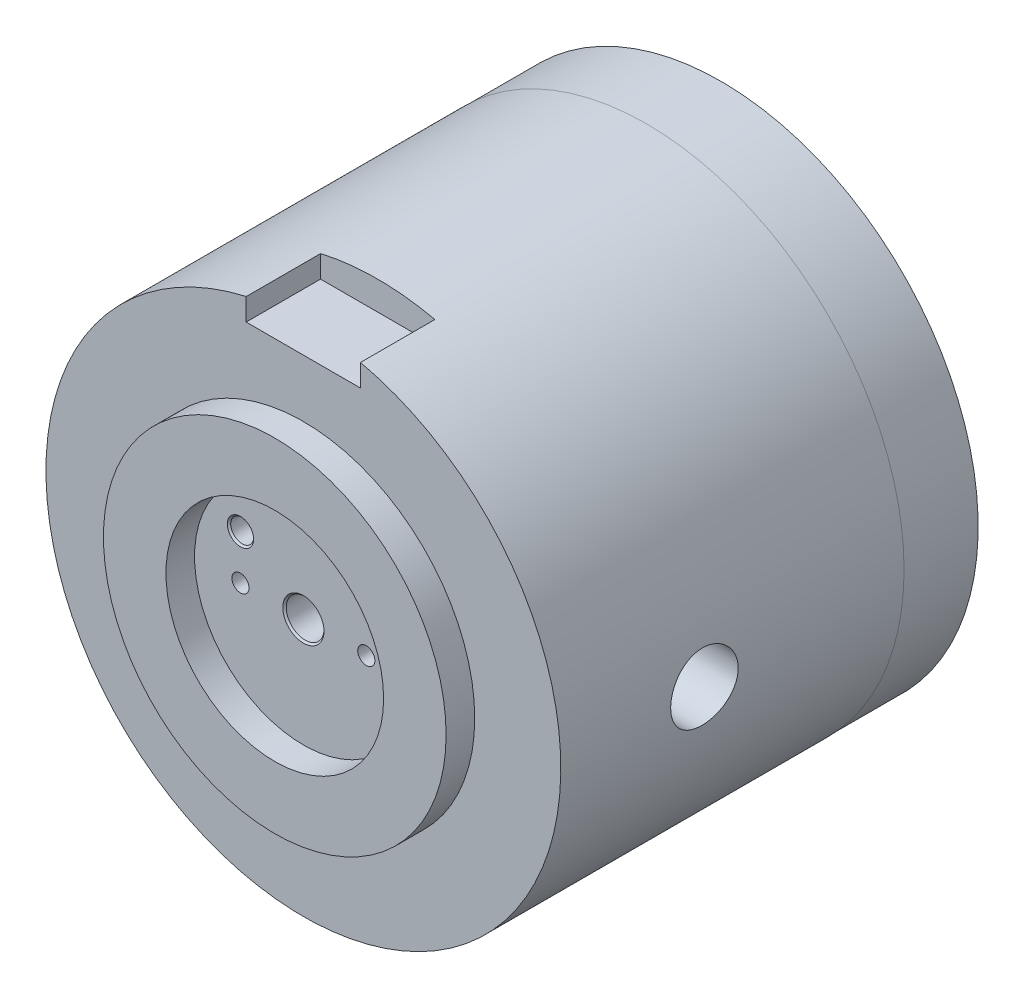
ISO-10303-21;
HEADER;
FILE_DESCRIPTION(('STEP AP214'),'2;1');
FILE_NAME('part.step','',(''),(''),'','','');
FILE_SCHEMA(('AUTOMOTIVE_DESIGN { 1 0 10303 214 1 1 1 1 }'));
ENDSEC;
DATA;
#1=APPLICATION_CONTEXT('core data for automotive mechanical design processes');
#2=APPLICATION_PROTOCOL_DEFINITION('international standard','automotive_design',2000,#1);
#3=PRODUCT_CONTEXT('',#1,'mechanical');
#4=PRODUCT('Part','Part','',(#3));
#5=PRODUCT_RELATED_PRODUCT_CATEGORY('part','',(#4));
#6=PRODUCT_DEFINITION_FORMATION('','',#4);
#7=PRODUCT_DEFINITION_CONTEXT('part definition',#1,'design');
#8=PRODUCT_DEFINITION('design','',#6,#7);
#9=PRODUCT_DEFINITION_SHAPE('','',#8);
#10=(LENGTH_UNIT() NAMED_UNIT(*) SI_UNIT(.MILLI.,.METRE.));
#11=(NAMED_UNIT(*) PLANE_ANGLE_UNIT() SI_UNIT($,.RADIAN.));
#12=(NAMED_UNIT(*) SI_UNIT($,.STERADIAN.) SOLID_ANGLE_UNIT());
#13=UNCERTAINTY_MEASURE_WITH_UNIT(LENGTH_MEASURE(1.E-05),#10,'distance_accuracy_value','');
#14=(GEOMETRIC_REPRESENTATION_CONTEXT(3) GLOBAL_UNCERTAINTY_ASSIGNED_CONTEXT((#13)) GLOBAL_UNIT_ASSIGNED_CONTEXT((#10,
#11,#12)) REPRESENTATION_CONTEXT('',''));
#15=CARTESIAN_POINT('',(0.,0.,0.));
#16=DIRECTION('',(0.,0.,1.));
#17=DIRECTION('',(1.,0.,0.));
#18=AXIS2_PLACEMENT_3D('',#15,#16,#17);
#19=CARTESIAN_POINT('',(0.,0.,60.));
#20=DIRECTION('',(0.,0.,-1.));
#21=DIRECTION('',(-1.,0.,0.));
#22=AXIS2_PLACEMENT_3D('',#19,#20,#21);
#23=CYLINDRICAL_SURFACE('',#22,45.);
#24=CARTESIAN_POINT('',(0.,0.,60.));
#25=DIRECTION('',(0.,0.,1.));
#26=DIRECTION('',(1.,0.,0.));
#27=AXIS2_PLACEMENT_3D('',#24,#25,#26);
#28=CIRCLE('',#27,45.);
#29=CARTESIAN_POINT('',(-9.98468180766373,43.8783104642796,60.));
#30=VERTEX_POINT('',#29);
#31=CARTESIAN_POINT('',(9.98468180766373,43.8783104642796,60.));
#32=VERTEX_POINT('',#31);
#33=EDGE_CURVE('E158',#30,#32,#28,.T.);
#34=ORIENTED_EDGE('',*,*,#33,.F.);
#35=DIRECTION('',(0.,0.,-1.));
#36=VECTOR('',#35,1.);
#37=CARTESIAN_POINT('',(-9.98468180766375,43.8783104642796,60.));
#38=LINE('',#37,#36);
#39=CARTESIAN_POINT('',(-9.98468180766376,43.8783104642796,47.));
#40=VERTEX_POINT('',#39);
#41=EDGE_CURVE('E120',#30,#40,#38,.T.);
#42=ORIENTED_EDGE('',*,*,#41,.T.);
#43=CARTESIAN_POINT('',(0.,0.,47.));
#44=DIRECTION('',(0.,0.,1.));
#45=DIRECTION('',(1.,0.,0.));
#46=AXIS2_PLACEMENT_3D('',#43,#44,#45);
#47=CIRCLE('',#46,45.);
#48=CARTESIAN_POINT('',(9.98468180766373,43.8783104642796,47.));
#49=VERTEX_POINT('',#48);
#50=EDGE_CURVE('E79',#49,#40,#47,.T.);
#51=ORIENTED_EDGE('',*,*,#50,.F.);
#52=DIRECTION('',(0.,0.,-1.));
#53=VECTOR('',#52,1.);
#54=CARTESIAN_POINT('',(9.98468180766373,43.8783104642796,60.));
#55=LINE('',#54,#53);
#56=EDGE_CURVE('E114',#49,#32,#55,.F.);
#57=ORIENTED_EDGE('',*,*,#56,.T.);
#58=EDGE_LOOP('',(#34,#42,#51,#57));
#59=FACE_BOUND('',#58,.T.);
#60=CARTESIAN_POINT('',(-45.,0.,14.0388753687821));
#61=CARTESIAN_POINT('',(-45.0000006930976,-0.164921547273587,14.0418319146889));
#62=CARTESIAN_POINT('',(-44.9990915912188,-0.329938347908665,14.0378654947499));
#63=CARTESIAN_POINT('',(-44.9954739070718,-0.659091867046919,14.0161241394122));
#64=CARTESIAN_POINT('',(-44.9927649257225,-0.823228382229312,13.9983461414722));
#65=CARTESIAN_POINT('',(-44.9856118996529,-1.14951182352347,13.9490906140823));
#66=CARTESIAN_POINT('',(-44.9811665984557,-1.31165722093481,13.9176031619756));
#67=CARTESIAN_POINT('',(-44.9706564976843,-1.63274792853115,13.8411481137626));
#68=CARTESIAN_POINT('',(-44.9645911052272,-1.79169204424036,13.7961755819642));
#69=CARTESIAN_POINT('',(-44.9510113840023,-2.10502824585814,13.6931409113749));
#70=CARTESIAN_POINT('',(-44.9434985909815,-2.2594249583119,13.6350926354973));
#71=CARTESIAN_POINT('',(-44.9272195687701,-2.56281699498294,13.5062784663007));
#72=CARTESIAN_POINT('',(-44.9184528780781,-2.71181030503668,13.4355078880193));
#73=CARTESIAN_POINT('',(-44.8999105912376,-3.00322107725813,13.2818135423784));
#74=CARTESIAN_POINT('',(-44.8901355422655,-3.14564204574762,13.1988963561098));
#75=CARTESIAN_POINT('',(-44.8698338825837,-3.42306321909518,13.0214347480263));
#76=CARTESIAN_POINT('',(-44.8593069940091,-3.55806064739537,12.9268860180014));
#77=CARTESIAN_POINT('',(-44.8377379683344,-3.82029455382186,12.726354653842));
#78=CARTESIAN_POINT('',(-44.8266935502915,-3.94748956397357,12.6203180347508));
#79=CARTESIAN_POINT('',(-44.8044375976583,-4.19255522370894,12.3978969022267));
#80=CARTESIAN_POINT('',(-44.7932260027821,-4.31042240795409,12.2815085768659));
#81=CARTESIAN_POINT('',(-44.7709527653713,-4.53592608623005,12.0392652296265));
#82=CARTESIAN_POINT('',(-44.7598910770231,-4.64356576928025,11.9134131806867));
#83=CARTESIAN_POINT('',(-44.7382166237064,-4.84794190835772,11.6530354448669));
#84=CARTESIAN_POINT('',(-44.7276040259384,-4.94467432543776,11.5185065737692));
#85=CARTESIAN_POINT('',(-44.7070887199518,-5.1268565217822,11.2412188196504));
#86=CARTESIAN_POINT('',(-44.6971888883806,-5.21226163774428,11.0984303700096));
#87=CARTESIAN_POINT('',(-44.6784203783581,-5.3707657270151,10.8060481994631));
#88=CARTESIAN_POINT('',(-44.6695520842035,-5.44386011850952,10.6564519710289));
#89=CARTESIAN_POINT('',(-44.6531071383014,-5.57714480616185,10.3516067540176));
#90=CARTESIAN_POINT('',(-44.6455299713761,-5.63734025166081,10.1963600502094));
#91=CARTESIAN_POINT('',(-44.6318757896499,-5.74443555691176,9.88126552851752));
#92=CARTESIAN_POINT('',(-44.6257993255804,-5.79133053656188,9.721416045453));
#93=CARTESIAN_POINT('',(-44.6101650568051,-5.91100095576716,9.23851617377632));
#94=CARTESIAN_POINT('',(-44.6030917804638,-5.96362808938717,8.91012674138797));
#95=CARTESIAN_POINT('',(-44.5964557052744,-6.01304626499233,8.2492840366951));
#96=CARTESIAN_POINT('',(-44.5968925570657,-6.00983990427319,7.91683095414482));
#97=CARTESIAN_POINT('',(-44.6051845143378,-5.94797956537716,7.25940224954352));
#98=CARTESIAN_POINT('',(-44.6129906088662,-5.8896919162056,6.9343917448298));
#99=CARTESIAN_POINT('',(-44.6350750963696,-5.71990618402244,6.29882662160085));
#100=CARTESIAN_POINT('',(-44.6493536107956,-5.60840710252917,5.98827227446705));
#101=CARTESIAN_POINT('',(-44.6828346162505,-5.33509079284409,5.38950822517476));
#102=CARTESIAN_POINT('',(-44.702049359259,-5.1731481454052,5.10135647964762));
#103=CARTESIAN_POINT('',(-44.743264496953,-4.80361632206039,4.55620095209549));
#104=CARTESIAN_POINT('',(-44.765265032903,-4.59602483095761,4.29919875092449));
#105=CARTESIAN_POINT('',(-44.8098215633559,-4.13918337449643,3.8215562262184));
#106=CARTESIAN_POINT('',(-44.8323805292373,-3.88962516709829,3.60121089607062));
#107=CARTESIAN_POINT('',(-44.8754088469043,-3.35692748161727,3.20548558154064));
#108=CARTESIAN_POINT('',(-44.8958781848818,-3.07378778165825,3.03010589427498));
#109=CARTESIAN_POINT('',(-44.9325039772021,-2.48154821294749,2.72918583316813));
#110=CARTESIAN_POINT('',(-44.9486563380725,-2.17242406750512,2.60369270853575));
#111=CARTESIAN_POINT('',(-44.974858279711,-1.5372280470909,2.40648851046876));
#112=CARTESIAN_POINT('',(-44.9849081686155,-1.2111570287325,2.33477472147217));
#113=CARTESIAN_POINT('',(-44.9977837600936,-0.55382432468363,2.24759747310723));
#114=CARTESIAN_POINT('',(-45.0006607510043,-0.222616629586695,2.23173432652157));
#115=CARTESIAN_POINT('',(-44.9990820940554,0.437762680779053,2.25562007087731));
#116=CARTESIAN_POINT('',(-44.9946266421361,0.766934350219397,2.29536747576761));
#117=CARTESIAN_POINT('',(-44.978980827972,1.41250595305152,2.42900114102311));
#118=CARTESIAN_POINT('',(-44.9678181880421,1.72895276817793,2.52266448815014));
#119=CARTESIAN_POINT('',(-44.9400801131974,2.34165198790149,2.76122110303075));
#120=CARTESIAN_POINT('',(-44.9235044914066,2.63790369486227,2.90611613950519));
#121=CARTESIAN_POINT('',(-44.886727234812,3.2035242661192,3.24390218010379));
#122=CARTESIAN_POINT('',(-44.8665069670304,3.47274336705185,3.43704188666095));
#123=CARTESIAN_POINT('',(-44.8247952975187,3.97509512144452,3.86551720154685));
#124=CARTESIAN_POINT('',(-44.8033038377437,4.20822612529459,4.10085473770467));
#125=CARTESIAN_POINT('',(-44.7613463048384,4.63334887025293,4.60889683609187));
#126=CARTESIAN_POINT('',(-44.7408879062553,4.82505992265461,4.88183700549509));
#127=CARTESIAN_POINT('',(-44.7035093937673,5.15991838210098,5.45627579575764));
#128=CARTESIAN_POINT('',(-44.6865892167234,5.30306665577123,5.75777390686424));
#129=CARTESIAN_POINT('',(-44.6582871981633,5.53635483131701,6.38003175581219));
#130=CARTESIAN_POINT('',(-44.6468925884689,5.62661704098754,6.7007451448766));
#131=CARTESIAN_POINT('',(-44.6309250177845,5.75192784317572,7.3531242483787));
#132=CARTESIAN_POINT('',(-44.6263516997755,5.78697932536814,7.68478938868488));
#133=CARTESIAN_POINT('',(-44.6249953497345,5.79738130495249,8.18155902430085));
#134=CARTESIAN_POINT('',(-44.6254498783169,5.79390084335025,8.34647596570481));
#135=CARTESIAN_POINT('',(-44.6281396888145,5.77315363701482,8.67540918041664));
#136=CARTESIAN_POINT('',(-44.6303743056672,5.75589204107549,8.83942576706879));
#137=CARTESIAN_POINT('',(-44.6365632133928,5.70769667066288,9.16545290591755));
#138=CARTESIAN_POINT('',(-44.6405181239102,5.67675796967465,9.32746271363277));
#139=CARTESIAN_POINT('',(-44.6500296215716,5.60145480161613,9.64822371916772));
#140=CARTESIAN_POINT('',(-44.6555856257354,5.55709522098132,9.80697608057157));
#141=CARTESIAN_POINT('',(-44.6681348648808,5.45530495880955,10.1200599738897));
#142=CARTESIAN_POINT('',(-44.6751271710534,5.3978827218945,10.2743942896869));
#143=CARTESIAN_POINT('',(-44.6903467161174,5.27039159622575,10.5776180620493));
#144=CARTESIAN_POINT('',(-44.6985735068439,5.20032729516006,10.726509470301));
#145=CARTESIAN_POINT('',(-44.7160313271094,5.04801123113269,11.0179300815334));
#146=CARTESIAN_POINT('',(-44.7252627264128,4.96575497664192,11.1604569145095));
#147=CARTESIAN_POINT('',(-44.7444603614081,4.78968712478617,11.4380597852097));
#148=CARTESIAN_POINT('',(-44.7544263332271,4.69587966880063,11.5731384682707));
#149=CARTESIAN_POINT('',(-44.7748900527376,4.49659050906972,11.8359645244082));
#150=CARTESIAN_POINT('',(-44.785391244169,4.39102609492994,11.963648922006));
#151=CARTESIAN_POINT('',(-44.8065498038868,4.16958715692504,12.2096416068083));
#152=CARTESIAN_POINT('',(-44.8172071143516,4.05371637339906,12.3279532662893));
#153=CARTESIAN_POINT('',(-44.8383825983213,3.81236481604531,12.554498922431));
#154=CARTESIAN_POINT('',(-44.8489006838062,3.68687827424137,12.662726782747));
#155=CARTESIAN_POINT('',(-44.8694854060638,3.42727644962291,12.8682286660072));
#156=CARTESIAN_POINT('',(-44.8795522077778,3.29316436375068,12.9655067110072));
#157=CARTESIAN_POINT('',(-44.8989980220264,3.0165043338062,13.1489302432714));
#158=CARTESIAN_POINT('',(-44.908373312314,2.87391727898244,13.2350171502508));
#159=CARTESIAN_POINT('',(-44.9261030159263,2.58198437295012,13.3948289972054));
#160=CARTESIAN_POINT('',(-44.9344578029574,2.4326410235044,13.4685584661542));
#161=CARTESIAN_POINT('',(-44.94989940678,2.12831602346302,13.6031043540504));
#162=CARTESIAN_POINT('',(-44.9569871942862,1.97333879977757,13.6639306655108));
#163=CARTESIAN_POINT('',(-44.9696917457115,1.65879759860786,13.7722768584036));
#164=CARTESIAN_POINT('',(-44.9753088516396,1.49923469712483,13.819799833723));
#165=CARTESIAN_POINT('',(-44.986605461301,1.11939147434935,13.9156359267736));
#166=CARTESIAN_POINT('',(-44.9916017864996,0.897631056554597,13.9582620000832));
#167=CARTESIAN_POINT('',(-44.9982985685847,0.450639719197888,14.0178611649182));
#168=CARTESIAN_POINT('',(-44.9999990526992,0.225408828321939,14.0348344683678));
#169=CARTESIAN_POINT('',(-45.,0.,14.0388753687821));
#170=B_SPLINE_CURVE_WITH_KNOTS('',3,(#60,#61,#62,#63,#64,#65,#66,#67,#68,#69,#70,#71,#72,#73,
#74,#75,#76,#77,#78,#79,#80,#81,#82,#83,#84,#85,#86,#87,#88,#89,#90,#91,#92,#93,#94,#95,#96,#97,
#98,#99,#100,#101,#102,#103,#104,#105,#106,#107,#108,#109,#110,#111,#112,#113,#114,#115,#116,
#117,#118,#119,#120,#121,#122,#123,#124,#125,#126,#127,#128,#129,#130,#131,#132,#133,#134,#135,
#136,#137,#138,#139,#140,#141,#142,#143,#144,#145,#146,#147,#148,#149,#150,#151,#152,#153,#154,
#155,#156,#157,#158,#159,#160,#161,#162,#163,#164,#165,#166,#167,#168,#169),.UNSPECIFIED.,.T.,
.F.,(4,2,2,2,2,2,2,2,2,2,2,2,2,2,2,2,2,2,2,2,2,2,2,2,2,2,2,2,2,2,2,2,2,2,2,2,2,2,2,2,2,2,2,2,2,
2,2,2,2,2,2,2,2,2,4),(0.,0.494646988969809,0.989403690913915,1.48451908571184,1.97981592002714,
2.47459009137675,2.96954683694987,3.4642363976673,3.95910974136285,4.45641874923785,
4.95391165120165,5.45124891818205,5.94876974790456,6.44819739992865,6.94781052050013,
7.44722381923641,7.94682012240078,8.93958302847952,9.9322997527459,10.918460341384,
11.9046394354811,12.8932903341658,13.8819913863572,14.8782997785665,15.8746147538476,
16.8718711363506,17.8690771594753,18.8591321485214,19.8491606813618,20.8351250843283,
21.821123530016,22.8123136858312,23.8035491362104,24.8013046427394,25.7990423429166,
26.7944634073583,27.7898323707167,28.2842134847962,28.7784099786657,29.2727846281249,
29.7669794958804,30.2608557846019,30.7545532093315,31.2484329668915,31.7421361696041,
32.2395628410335,32.7368097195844,33.2343572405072,33.731721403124,34.2315923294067,
34.7312796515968,35.2305824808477,35.7297690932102,36.4058403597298,37.0819060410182),.UNSPECIFIED.);
#171=CARTESIAN_POINT('',(-45.,0.,14.0388753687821));
#172=VERTEX_POINT('',#171);
#173=EDGE_CURVE('E129',#172,#172,#170,.T.);
#174=ORIENTED_EDGE('',*,*,#173,.T.);
#175=EDGE_LOOP('',(#174));
#176=FACE_BOUND('',#175,.T.);
#177=CARTESIAN_POINT('',(44.6671431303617,5.46317898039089,34.8948618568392));
#178=CARTESIAN_POINT('',(44.66714243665,5.46318096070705,34.7298672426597));
#179=CARTESIAN_POINT('',(44.6679925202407,5.45624674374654,34.5649012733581));
#180=CARTESIAN_POINT('',(44.6713655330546,5.42856389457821,34.2360976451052));
#181=CARTESIAN_POINT('',(44.6738888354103,5.40781218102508,34.0722602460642));
#182=CARTESIAN_POINT('',(44.6805346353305,5.35262490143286,33.7468206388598));
#183=CARTESIAN_POINT('',(44.6846583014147,5.31817933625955,33.5852201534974));
#184=CARTESIAN_POINT('',(44.694380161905,5.2358475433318,33.2654617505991));
#185=CARTESIAN_POINT('',(44.6999788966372,5.18795638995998,33.1073051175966));
#186=CARTESIAN_POINT('',(44.7124726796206,5.07915143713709,32.7957817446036));
#187=CARTESIAN_POINT('',(44.7193663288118,5.01825168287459,32.6424100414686));
#188=CARTESIAN_POINT('',(44.7342474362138,4.88381801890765,32.3412952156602));
#189=CARTESIAN_POINT('',(44.7422352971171,4.81027945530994,32.1935541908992));
#190=CARTESIAN_POINT('',(44.7590565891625,4.651155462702,31.9048645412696));
#191=CARTESIAN_POINT('',(44.767889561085,4.56557656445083,31.7639122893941));
#192=CARTESIAN_POINT('',(44.7861416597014,4.38291448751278,31.48963550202));
#193=CARTESIAN_POINT('',(44.7955610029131,4.28582704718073,31.3563138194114));
#194=CARTESIAN_POINT('',(44.8147478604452,4.0803277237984,31.0976093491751));
#195=CARTESIAN_POINT('',(44.8245169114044,3.97186036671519,30.9722707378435));
#196=CARTESIAN_POINT('',(44.8440626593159,3.74473459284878,30.731107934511));
#197=CARTESIAN_POINT('',(44.8538393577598,3.62607242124,30.6152872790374));
#198=CARTESIAN_POINT('',(44.8730938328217,3.37945827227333,30.3940539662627));
#199=CARTESIAN_POINT('',(44.8825717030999,3.25150924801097,30.2886380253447));
#200=CARTESIAN_POINT('',(44.9009422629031,2.98713002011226,30.088874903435));
#201=CARTESIAN_POINT('',(44.9098347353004,2.85069670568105,29.9945318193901));
#202=CARTESIAN_POINT('',(44.9267800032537,2.56988006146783,29.8173370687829));
#203=CARTESIAN_POINT('',(44.934829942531,2.42547207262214,29.7345241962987));
#204=CARTESIAN_POINT('',(44.9498011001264,2.13008522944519,29.5813284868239));
#205=CARTESIAN_POINT('',(44.9567218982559,1.97910395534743,29.5109502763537));
#206=CARTESIAN_POINT('',(44.9691995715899,1.67173811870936,29.3832024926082));
#207=CARTESIAN_POINT('',(44.9747569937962,1.51535575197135,29.3258277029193));
#208=CARTESIAN_POINT('',(44.9843245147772,1.19824963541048,29.2244596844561));
#209=CARTESIAN_POINT('',(44.9883340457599,1.03752431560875,29.1804713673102));
#210=CARTESIAN_POINT('',(44.9977583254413,0.552541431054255,29.0696153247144));
#211=CARTESIAN_POINT('',(45.0006584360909,0.223347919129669,29.0229747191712));
#212=CARTESIAN_POINT('',(44.999085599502,-0.437995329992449,28.9855609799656));
#213=CARTESIAN_POINT('',(44.9946129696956,-0.770144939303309,28.9947854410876));
#214=CARTESIAN_POINT('',(44.9785872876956,-1.42604267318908,29.0685138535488));
#215=CARTESIAN_POINT('',(44.9670778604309,-1.74982985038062,29.1326781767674));
#216=CARTESIAN_POINT('',(44.9380309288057,-2.38192687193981,29.3139531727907));
#217=CARTESIAN_POINT('',(44.9204933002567,-2.69023639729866,29.4310649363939));
#218=CARTESIAN_POINT('',(44.8810216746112,-3.2836994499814,29.71526337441));
#219=CARTESIAN_POINT('',(44.8590748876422,-3.56878213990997,29.8824961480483));
#220=CARTESIAN_POINT('',(44.813012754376,-4.10693919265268,30.2620845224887));
#221=CARTESIAN_POINT('',(44.7888972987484,-4.36001194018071,30.4744423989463));
#222=CARTESIAN_POINT('',(44.7407762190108,-4.82897955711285,30.940152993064));
#223=CARTESIAN_POINT('',(44.7167727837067,-5.04458061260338,31.1938019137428));
#224=CARTESIAN_POINT('',(44.6715854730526,-5.43021810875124,31.7338795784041));
#225=CARTESIAN_POINT('',(44.6504016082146,-5.60025437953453,32.0203084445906));
#226=CARTESIAN_POINT('',(44.6131108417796,-5.88997386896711,32.6180872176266));
#227=CARTESIAN_POINT('',(44.597006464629,-6.00963206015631,32.9294494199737));
#228=CARTESIAN_POINT('',(44.571644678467,-6.19494304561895,33.5681135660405));
#229=CARTESIAN_POINT('',(44.5623869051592,-6.26059871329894,33.8954146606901));
#230=CARTESIAN_POINT('',(44.5517778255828,-6.3356564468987,34.5540663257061));
#231=CARTESIAN_POINT('',(44.5503683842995,-6.34547214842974,34.8853688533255));
#232=CARTESIAN_POINT('',(44.5554535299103,-6.30966519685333,35.5448959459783));
#233=CARTESIAN_POINT('',(44.5619479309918,-6.26404384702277,35.8731205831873));
#234=CARTESIAN_POINT('',(44.5820938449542,-6.1190016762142,36.5159240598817));
#235=CARTESIAN_POINT('',(44.5957185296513,-6.01978247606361,36.8305492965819));
#236=CARTESIAN_POINT('',(44.6286495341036,-5.77055864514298,37.4386770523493));
#237=CARTESIAN_POINT('',(44.6479560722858,-5.62055206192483,37.7321787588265));
#238=CARTESIAN_POINT('',(44.6903382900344,-5.27298547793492,38.2915980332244));
#239=CARTESIAN_POINT('',(44.7134351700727,-5.0751548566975,38.5573458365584));
#240=CARTESIAN_POINT('',(44.760897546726,-4.63791803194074,39.051978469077));
#241=CARTESIAN_POINT('',(44.7852630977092,-4.39851004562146,39.2808617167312));
#242=CARTESIAN_POINT('',(44.8328997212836,-3.88308968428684,39.6967308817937));
#243=CARTESIAN_POINT('',(44.8561629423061,-3.60685646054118,39.8834441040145));
#244=CARTESIAN_POINT('',(44.8990399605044,-3.02666085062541,40.2077816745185));
#245=CARTESIAN_POINT('',(44.9186538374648,-2.72269907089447,40.3454070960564));
#246=CARTESIAN_POINT('',(44.9522213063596,-2.09661640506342,40.5672213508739));
#247=CARTESIAN_POINT('',(44.9661913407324,-1.77455142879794,40.6515658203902));
#248=CARTESIAN_POINT('',(44.9872359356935,-1.12043065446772,40.7649075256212));
#249=CARTESIAN_POINT('',(44.9943108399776,-0.788375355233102,40.7939075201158));
#250=CARTESIAN_POINT('',(44.9993596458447,-0.291707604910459,40.7953026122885));
#251=CARTESIAN_POINT('',(45.0001217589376,-0.126919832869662,40.7888385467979));
#252=CARTESIAN_POINT('',(44.9998473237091,0.201520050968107,40.7621541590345));
#253=CARTESIAN_POINT('',(44.9988114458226,0.365172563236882,40.7419389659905));
#254=CARTESIAN_POINT('',(44.9950000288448,0.690240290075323,40.6878868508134));
#255=CARTESIAN_POINT('',(44.992223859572,0.851654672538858,40.6540449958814));
#256=CARTESIAN_POINT('',(44.9850447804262,1.17099905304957,40.5730084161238));
#257=CARTESIAN_POINT('',(44.9806424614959,1.32893029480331,40.5258185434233));
#258=CARTESIAN_POINT('',(44.970366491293,1.6402427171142,40.4184298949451));
#259=CARTESIAN_POINT('',(44.9644929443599,1.79362421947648,40.3582320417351));
#260=CARTESIAN_POINT('',(44.9514719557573,2.09472454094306,40.2252856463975));
#261=CARTESIAN_POINT('',(44.9443249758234,2.24244538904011,40.1525416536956));
#262=CARTESIAN_POINT('',(44.9289815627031,2.5313132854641,39.9949778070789));
#263=CARTESIAN_POINT('',(44.9207847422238,2.67245788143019,39.9101534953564));
#264=CARTESIAN_POINT('',(44.9036030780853,2.94709305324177,39.7290798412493));
#265=CARTESIAN_POINT('',(44.8946185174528,3.08058634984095,39.6328345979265));
#266=CARTESIAN_POINT('',(44.8760648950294,3.34003672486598,39.4287947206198));
#267=CARTESIAN_POINT('',(44.8664919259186,3.46592915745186,39.3209182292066));
#268=CARTESIAN_POINT('',(44.8471224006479,3.70814949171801,39.095017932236));
#269=CARTESIAN_POINT('',(44.8373259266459,3.82448083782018,38.9769978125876));
#270=CARTESIAN_POINT('',(44.8177998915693,4.04688591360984,38.731522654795));
#271=CARTESIAN_POINT('',(44.8080703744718,4.15295340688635,38.6040619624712));
#272=CARTESIAN_POINT('',(44.7889847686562,4.35396787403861,38.3407027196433));
#273=CARTESIAN_POINT('',(44.7796285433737,4.44891893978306,38.2048073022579));
#274=CARTESIAN_POINT('',(44.7615289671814,4.62748518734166,37.9248321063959));
#275=CARTESIAN_POINT('',(44.7527886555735,4.71104582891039,37.7807173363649));
#276=CARTESIAN_POINT('',(44.7362410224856,4.86567424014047,37.4859517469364));
#277=CARTESIAN_POINT('',(44.7284333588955,4.93674659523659,37.3353033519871));
#278=CARTESIAN_POINT('',(44.7139937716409,5.06586451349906,37.028601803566));
#279=CARTESIAN_POINT('',(44.7073609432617,5.12392010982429,36.8725529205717));
#280=CARTESIAN_POINT('',(44.6954698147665,5.22662830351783,36.5561091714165));
#281=CARTESIAN_POINT('',(44.6902111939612,5.27128402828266,36.3957153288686));
#282=CARTESIAN_POINT('',(44.6796482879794,5.36019856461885,36.0145411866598));
#283=CARTESIAN_POINT('',(44.6749805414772,5.39877551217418,35.7923933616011));
#284=CARTESIAN_POINT('',(44.6687284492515,5.45026425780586,35.3450998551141));
#285=CARTESIAN_POINT('',(44.6671440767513,5.46317627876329,35.1199541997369));
#286=CARTESIAN_POINT('',(44.6671431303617,5.46317898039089,34.8948618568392));
#287=B_SPLINE_CURVE_WITH_KNOTS('',3,(#177,#178,#179,#180,#181,#182,#183,#184,#185,#186,#187,
#188,#189,#190,#191,#192,#193,#194,#195,#196,#197,#198,#199,#200,#201,#202,#203,#204,#205,#206,
#207,#208,#209,#210,#211,#212,#213,#214,#215,#216,#217,#218,#219,#220,#221,#222,#223,#224,#225,
#226,#227,#228,#229,#230,#231,#232,#233,#234,#235,#236,#237,#238,#239,#240,#241,#242,#243,#244,
#245,#246,#247,#248,#249,#250,#251,#252,#253,#254,#255,#256,#257,#258,#259,#260,#261,#262,#263,
#264,#265,#266,#267,#268,#269,#270,#271,#272,#273,#274,#275,#276,#277,#278,#279,#280,#281,#282,
#283,#284,#285,#286),.UNSPECIFIED.,.T.,.F.,(4,2,2,2,2,2,2,2,2,2,2,2,2,2,2,2,2,2,2,2,2,2,2,2,2,2,
2,2,2,2,2,2,2,2,2,2,2,2,2,2,2,2,2,2,2,2,2,2,2,2,2,2,2,2,4),(0.,0.49478678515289,
0.989683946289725,1.48494314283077,1.9803840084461,2.47529263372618,2.97038388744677,
3.46520762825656,3.96021517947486,4.45775898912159,4.95548683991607,5.45305710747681,
5.95081089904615,6.45020090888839,6.94977633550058,7.44915099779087,7.94870866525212,
8.94099403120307,9.93323667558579,10.9193893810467,11.905562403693,12.894638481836,
13.8837644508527,14.8803268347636,15.8768929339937,16.8739535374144,17.8709610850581,
18.8605735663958,19.8501627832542,20.8360550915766,21.8219853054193,22.8136308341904,
23.8053188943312,24.803247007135,25.8011532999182,26.7961310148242,27.7910591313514,
28.2853267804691,28.7794101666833,29.2736725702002,29.7677555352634,30.2618034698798,
30.7556726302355,31.2497245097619,31.743599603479,32.2412105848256,32.7386415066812,
33.2363727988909,33.7339203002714,34.2337722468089,34.7334402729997,35.2327218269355,
35.7318867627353,36.4069008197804,37.0819090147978),.UNSPECIFIED.);
#288=CARTESIAN_POINT('',(44.6671431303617,5.46317898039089,34.8948618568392));
#289=VERTEX_POINT('',#288);
#290=EDGE_CURVE('E157',#289,#289,#287,.T.);
#291=ORIENTED_EDGE('',*,*,#290,.T.);
#292=EDGE_LOOP('',(#291));
#293=FACE_BOUND('',#292,.T.);
#294=CARTESIAN_POINT('',(0.,0.,0.));
#295=DIRECTION('',(0.,0.,1.));
#296=DIRECTION('',(1.,0.,0.));
#297=AXIS2_PLACEMENT_3D('',#294,#295,#296);
#298=CIRCLE('',#297,45.);
#299=CARTESIAN_POINT('',(45.,0.,0.));
#300=VERTEX_POINT('',#299);
#301=EDGE_CURVE('E153',#300,#300,#298,.T.);
#302=ORIENTED_EDGE('',*,*,#301,.T.);
#303=EDGE_LOOP('',(#302));
#304=FACE_BOUND('',#303,.T.);
#305=ADVANCED_FACE('F16',(#59,#176,#293,#304),#23,.T.);
#306=CARTESIAN_POINT('',(0.,0.,60.));
#307=DIRECTION('',(0.,0.,1.));
#308=DIRECTION('',(1.,0.,0.));
#309=AXIS2_PLACEMENT_3D('',#306,#307,#308);
#310=PLANE('',#309);
#311=DIRECTION('',(-0.871568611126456,-0.490273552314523,0.));
#312=VECTOR('',#311,1.);
#313=CARTESIAN_POINT('',(-21.149510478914,37.5978867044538,60.));
#314=LINE('',#313,#312);
#315=CARTESIAN_POINT('',(-10.,43.8696936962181,60.));
#316=VERTEX_POINT('',#315);
#317=EDGE_CURVE('E86',#30,#316,#314,.T.);
#318=ORIENTED_EDGE('',*,*,#317,.F.);
#319=ORIENTED_EDGE('',*,*,#33,.T.);
#320=DIRECTION('',(-0.871568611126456,0.490273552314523,0.));
#321=VECTOR('',#320,1.);
#322=CARTESIAN_POINT('',(0.,49.4948796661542,60.));
#323=LINE('',#322,#321);
#324=CARTESIAN_POINT('',(10.,43.8696936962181,60.));
#325=VERTEX_POINT('',#324);
#326=EDGE_CURVE('E82',#325,#32,#323,.T.);
#327=ORIENTED_EDGE('',*,*,#326,.F.);
#328=DIRECTION('',(0.,1.,0.));
#329=VECTOR('',#328,1.);
#330=CARTESIAN_POINT('',(10.,40.,60.));
#331=LINE('',#330,#329);
#332=CARTESIAN_POINT('',(10.,40.,60.));
#333=VERTEX_POINT('',#332);
#334=EDGE_CURVE('E108',#333,#325,#331,.T.);
#335=ORIENTED_EDGE('',*,*,#334,.F.);
#336=DIRECTION('',(1.,0.,0.));
#337=VECTOR('',#336,1.);
#338=CARTESIAN_POINT('',(-10.,40.,60.));
#339=LINE('',#338,#337);
#340=CARTESIAN_POINT('',(-10.,40.,60.));
#341=VERTEX_POINT('',#340);
#342=EDGE_CURVE('E104',#341,#333,#339,.T.);
#343=ORIENTED_EDGE('',*,*,#342,.F.);
#344=DIRECTION('',(0.,-1.,0.));
#345=VECTOR('',#344,1.);
#346=CARTESIAN_POINT('',(-10.,43.8696936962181,60.));
#347=LINE('',#346,#345);
#348=EDGE_CURVE('E102',#316,#341,#347,.T.);
#349=ORIENTED_EDGE('',*,*,#348,.F.);
#350=EDGE_LOOP('',(#318,#319,#327,#335,#343,#349));
#351=FACE_BOUND('',#350,.T.);
#352=CARTESIAN_POINT('',(0.,0.,60.));
#353=DIRECTION('',(0.,0.,1.));
#354=DIRECTION('',(1.,0.,0.));
#355=AXIS2_PLACEMENT_3D('',#352,#353,#354);
#356=CIRCLE('',#355,29.95);
#357=CARTESIAN_POINT('',(29.95,0.,60.));
#358=VERTEX_POINT('',#357);
#359=EDGE_CURVE('E154',#358,#358,#356,.T.);
#360=ORIENTED_EDGE('',*,*,#359,.F.);
#361=EDGE_LOOP('',(#360));
#362=FACE_BOUND('',#361,.T.);
#363=ADVANCED_FACE('F263',(#351,#362),#310,.T.);
#364=CARTESIAN_POINT('',(0.,0.,0.));
#365=DIRECTION('',(0.,0.,1.));
#366=DIRECTION('',(1.,0.,0.));
#367=AXIS2_PLACEMENT_3D('',#364,#365,#366);
#368=PLANE('',#367);
#369=CARTESIAN_POINT('',(0.,0.,0.));
#370=DIRECTION('',(0.,0.,-1.));
#371=DIRECTION('',(-1.,0.,0.));
#372=AXIS2_PLACEMENT_3D('',#369,#370,#371);
#373=CIRCLE('',#372,44.95);
#374=CARTESIAN_POINT('',(-44.95,0.,0.));
#375=VERTEX_POINT('',#374);
#376=EDGE_CURVE('E126',#375,#375,#373,.T.);
#377=ORIENTED_EDGE('',*,*,#376,.F.);
#378=EDGE_LOOP('',(#377));
#379=FACE_BOUND('',#378,.T.);
#380=ORIENTED_EDGE('',*,*,#301,.F.);
#381=EDGE_LOOP('',(#380));
#382=FACE_BOUND('',#381,.T.);
#383=ADVANCED_FACE('F269',(#379,#382),#368,.F.);
#384=CARTESIAN_POINT('',(0.,0.,65.));
#385=DIRECTION('',(0.,0.,-1.));
#386=DIRECTION('',(-1.,0.,0.));
#387=AXIS2_PLACEMENT_3D('',#384,#385,#386);
#388=CYLINDRICAL_SURFACE('',#387,29.95);
#389=CARTESIAN_POINT('',(0.,0.,65.));
#390=DIRECTION('',(0.,0.,1.));
#391=DIRECTION('',(1.,0.,0.));
#392=AXIS2_PLACEMENT_3D('',#389,#390,#391);
#393=CIRCLE('',#392,29.95);
#394=CARTESIAN_POINT('',(29.95,0.,65.));
#395=VERTEX_POINT('',#394);
#396=EDGE_CURVE('E148',#395,#395,#393,.T.);
#397=ORIENTED_EDGE('',*,*,#396,.F.);
#398=EDGE_LOOP('',(#397));
#399=FACE_BOUND('',#398,.T.);
#400=ORIENTED_EDGE('',*,*,#359,.T.);
#401=EDGE_LOOP('',(#400));
#402=FACE_BOUND('',#401,.T.);
#403=ADVANCED_FACE('F282',(#399,#402),#388,.T.);
#404=CARTESIAN_POINT('',(0.,0.,65.));
#405=DIRECTION('',(0.,0.,1.));
#406=DIRECTION('',(1.,0.,0.));
#407=AXIS2_PLACEMENT_3D('',#404,#405,#406);
#408=PLANE('',#407);
#409=CARTESIAN_POINT('',(0.,0.,65.));
#410=DIRECTION('',(0.,0.,1.));
#411=DIRECTION('',(1.,0.,0.));
#412=AXIS2_PLACEMENT_3D('',#409,#410,#411);
#413=CIRCLE('',#412,19.025);
#414=CARTESIAN_POINT('',(19.025,0.,65.));
#415=VERTEX_POINT('',#414);
#416=EDGE_CURVE('E144',#415,#415,#413,.T.);
#417=ORIENTED_EDGE('',*,*,#416,.F.);
#418=EDGE_LOOP('',(#417));
#419=FACE_BOUND('',#418,.T.);
#420=ORIENTED_EDGE('',*,*,#396,.T.);
#421=EDGE_LOOP('',(#420));
#422=FACE_BOUND('',#421,.T.);
#423=ADVANCED_FACE('F288',(#419,#422),#408,.T.);
#424=CARTESIAN_POINT('',(0.,0.,60.));
#425=DIRECTION('',(0.,0.,1.));
#426=DIRECTION('',(1.,0.,0.));
#427=AXIS2_PLACEMENT_3D('',#424,#425,#426);
#428=CYLINDRICAL_SURFACE('',#427,19.025);
#429=CARTESIAN_POINT('',(0.,0.,60.));
#430=DIRECTION('',(0.,0.,1.));
#431=DIRECTION('',(1.,0.,0.));
#432=AXIS2_PLACEMENT_3D('',#429,#430,#431);
#433=CIRCLE('',#432,19.025);
#434=CARTESIAN_POINT('',(19.025,0.,60.));
#435=VERTEX_POINT('',#434);
#436=EDGE_CURVE('E145',#435,#435,#433,.T.);
#437=ORIENTED_EDGE('',*,*,#436,.F.);
#438=EDGE_LOOP('',(#437));
#439=FACE_BOUND('',#438,.T.);
#440=ORIENTED_EDGE('',*,*,#416,.T.);
#441=EDGE_LOOP('',(#440));
#442=FACE_BOUND('',#441,.T.);
#443=ADVANCED_FACE('F294',(#439,#442),#428,.F.);
#444=CARTESIAN_POINT('',(0.,0.,60.));
#445=DIRECTION('',(0.,0.,1.));
#446=DIRECTION('',(1.,0.,0.));
#447=AXIS2_PLACEMENT_3D('',#444,#445,#446);
#448=PLANE('',#447);
#449=CARTESIAN_POINT('',(-11.,7.78,60.));
#450=DIRECTION('',(0.,0.,1.));
#451=DIRECTION('',(1.,0.,0.));
#452=AXIS2_PLACEMENT_3D('',#449,#450,#451);
#453=CIRCLE('',#452,2.3);
#454=CARTESIAN_POINT('',(-8.7,7.78,60.));
#455=VERTEX_POINT('',#454);
#456=EDGE_CURVE('E25',#455,#455,#453,.F.);
#457=ORIENTED_EDGE('',*,*,#456,.T.);
#458=EDGE_LOOP('',(#457));
#459=FACE_BOUND('',#458,.T.);
#460=CARTESIAN_POINT('',(0.,0.,60.));
#461=DIRECTION('',(0.,0.,1.));
#462=DIRECTION('',(1.,0.,0.));
#463=AXIS2_PLACEMENT_3D('',#460,#461,#462);
#464=CIRCLE('',#463,3.6);
#465=CARTESIAN_POINT('',(3.6,0.,60.));
#466=VERTEX_POINT('',#465);
#467=EDGE_CURVE('E321',#466,#466,#464,.F.);
#468=ORIENTED_EDGE('',*,*,#467,.T.);
#469=EDGE_LOOP('',(#468));
#470=FACE_BOUND('',#469,.T.);
#471=CARTESIAN_POINT('',(-11.,0.,60.));
#472=DIRECTION('',(0.,0.,1.));
#473=DIRECTION('',(1.,0.,0.));
#474=AXIS2_PLACEMENT_3D('',#471,#472,#473);
#475=CIRCLE('',#474,1.5);
#476=CARTESIAN_POINT('',(-9.5,0.,60.));
#477=VERTEX_POINT('',#476);
#478=EDGE_CURVE('E325',#477,#477,#475,.T.);
#479=ORIENTED_EDGE('',*,*,#478,.F.);
#480=EDGE_LOOP('',(#479));
#481=FACE_BOUND('',#480,.T.);
#482=CARTESIAN_POINT('',(11.,0.,60.));
#483=DIRECTION('',(0.,0.,1.));
#484=DIRECTION('',(1.,0.,0.));
#485=AXIS2_PLACEMENT_3D('',#482,#483,#484);
#486=CIRCLE('',#485,1.5);
#487=CARTESIAN_POINT('',(12.5,0.,60.));
#488=VERTEX_POINT('',#487);
#489=EDGE_CURVE('E328',#488,#488,#486,.T.);
#490=ORIENTED_EDGE('',*,*,#489,.F.);
#491=EDGE_LOOP('',(#490));
#492=FACE_BOUND('',#491,.T.);
#493=ORIENTED_EDGE('',*,*,#436,.T.);
#494=EDGE_LOOP('',(#493));
#495=FACE_BOUND('',#494,.T.);
#496=ADVANCED_FACE('F183',(#459,#470,#481,#492,#495),#448,.T.);
#497=CARTESIAN_POINT('',(44.9978455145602,-0.440339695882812,34.8948618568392));
#498=DIRECTION('',(0.999952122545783,-0.00978532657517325,0.));
#499=DIRECTION('',(0.00978532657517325,0.999952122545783,0.));
#500=AXIS2_PLACEMENT_3D('',#497,#498,#499);
#501=CYLINDRICAL_SURFACE('',#500,5.9);
#502=CARTESIAN_POINT('',(14.6792971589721,-0.14364859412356,34.8948618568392));
#503=DIRECTION('',(0.999952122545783,-0.00978532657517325,0.));
#504=DIRECTION('',(0.00978532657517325,0.999952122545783,0.));
#505=AXIS2_PLACEMENT_3D('',#502,#503,#504);
#506=CIRCLE('',#505,5.9);
#507=CARTESIAN_POINT('',(14.7370305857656,5.75606892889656,34.8948618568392));
#508=VERTEX_POINT('',#507);
#509=EDGE_CURVE('E141',#508,#508,#506,.T.);
#510=ORIENTED_EDGE('',*,*,#509,.F.);
#511=EDGE_LOOP('',(#510));
#512=FACE_BOUND('',#511,.T.);
#513=ORIENTED_EDGE('',*,*,#290,.F.);
#514=EDGE_LOOP('',(#513));
#515=FACE_BOUND('',#514,.T.);
#516=ADVANCED_FACE('F177',(#512,#515),#501,.F.);
#517=CARTESIAN_POINT('',(14.6792971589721,-0.14364859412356,34.8948618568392));
#518=DIRECTION('',(0.999952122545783,-0.00978532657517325,0.));
#519=DIRECTION('',(0.00978532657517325,0.999952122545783,0.));
#520=AXIS2_PLACEMENT_3D('',#517,#518,#519);
#521=CONICAL_SURFACE('',#520,5.9,1.02974425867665);
#522=CARTESIAN_POINT('',(12.3628627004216,-0.626582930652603,32.905238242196));
#523=CARTESIAN_POINT('',(12.3343661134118,-0.688587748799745,32.9689473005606));
#524=CARTESIAN_POINT('',(12.3039952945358,-0.74365820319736,33.0385529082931));
#525=CARTESIAN_POINT('',(12.2420454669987,-0.843060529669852,33.1847638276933));
#526=CARTESIAN_POINT('',(12.2104611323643,-0.887336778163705,33.261402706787));
#527=CARTESIAN_POINT('',(12.1502451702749,-0.963901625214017,33.4130424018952));
#528=CARTESIAN_POINT('',(12.1215773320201,-0.996860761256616,33.4876946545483));
#529=CARTESIAN_POINT('',(12.0656984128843,-1.05638662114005,33.6400884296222));
#530=CARTESIAN_POINT('',(12.0384886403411,-1.08294767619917,33.7178326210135));
#531=CARTESIAN_POINT('',(11.9867227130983,-1.13031213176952,33.8758583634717));
#532=CARTESIAN_POINT('',(11.9621650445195,-1.15111882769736,33.9561384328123));
#533=CARTESIAN_POINT('',(11.9170893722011,-1.18734281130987,34.1189896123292));
#534=CARTESIAN_POINT('',(11.8965690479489,-1.20276319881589,34.2015593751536));
#535=CARTESIAN_POINT('',(11.8651837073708,-1.22545651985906,34.3499557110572));
#536=CARTESIAN_POINT('',(11.8531853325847,-1.23378128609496,34.4153809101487));
#537=CARTESIAN_POINT('',(11.8334089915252,-1.2472264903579,34.5471959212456));
#538=CARTESIAN_POINT('',(11.8256301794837,-1.25234757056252,34.6135855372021));
#539=CARTESIAN_POINT('',(11.8149518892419,-1.25932328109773,34.746676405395));
#540=CARTESIAN_POINT('',(11.8120335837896,-1.261190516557,34.8133754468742));
#541=CARTESIAN_POINT('',(11.8112883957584,-1.26167011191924,34.9468146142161));
#542=CARTESIAN_POINT('',(11.8134614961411,-1.26028248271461,35.0135547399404));
#543=CARTESIAN_POINT('',(11.8226798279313,-1.254283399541,35.146311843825));
#544=CARTESIAN_POINT('',(11.8297083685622,-1.24968298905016,35.2123305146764));
#545=CARTESIAN_POINT('',(11.8480388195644,-1.23731608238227,35.3434953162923));
#546=CARTESIAN_POINT('',(11.8593431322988,-1.22954780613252,35.408640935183));
#547=CARTESIAN_POINT('',(11.8855266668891,-1.21082703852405,35.5381156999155));
#548=CARTESIAN_POINT('',(11.9004253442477,-1.19985714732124,35.6024383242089));
#549=CARTESIAN_POINT('',(11.93296938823,-1.1747299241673,35.7297234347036));
#550=CARTESIAN_POINT('',(11.950614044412,-1.16057341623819,35.7926862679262));
#551=CARTESIAN_POINT('',(11.9906319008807,-1.12669060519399,35.92611699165));
#552=CARTESIAN_POINT('',(12.0133201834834,-1.10645602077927,35.9963615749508));
#553=CARTESIAN_POINT('',(12.0604806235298,-1.06134245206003,36.1347725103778));
#554=CARTESIAN_POINT('',(12.0849536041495,-1.03646131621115,36.2029378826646));
#555=CARTESIAN_POINT('',(12.1347698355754,-0.981663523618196,36.3364454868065));
#556=CARTESIAN_POINT('',(12.1601080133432,-0.951773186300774,36.4018003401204));
#557=CARTESIAN_POINT('',(12.2110111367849,-0.886104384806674,36.529342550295));
#558=CARTESIAN_POINT('',(12.2365757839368,-0.850332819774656,36.5915335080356));
#559=CARTESIAN_POINT('',(12.2799511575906,-0.782844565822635,36.6946314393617));
#560=CARTESIAN_POINT('',(12.29791240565,-0.75283654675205,36.7365884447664));
#561=CARTESIAN_POINT('',(12.3331158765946,-0.688582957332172,36.8175800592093));
#562=CARTESIAN_POINT('',(12.350357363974,-0.654333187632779,36.85661170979));
#563=CARTESIAN_POINT('',(12.3836568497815,-0.58064311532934,36.9308678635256));
#564=CARTESIAN_POINT('',(12.3997026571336,-0.541158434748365,36.9660545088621));
#565=CARTESIAN_POINT('',(12.4295000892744,-0.456645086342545,37.030247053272));
#566=CARTESIAN_POINT('',(12.4432570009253,-0.411629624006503,37.0592672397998));
#567=CARTESIAN_POINT('',(12.4632276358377,-0.331748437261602,37.10024540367));
#568=CARTESIAN_POINT('',(12.4704343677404,-0.298411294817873,37.1146761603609));
#569=CARTESIAN_POINT('',(12.4827354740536,-0.229592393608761,37.1384473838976));
#570=CARTESIAN_POINT('',(12.48783228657,-0.194113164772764,37.1477937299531));
#571=CARTESIAN_POINT('',(12.4955170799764,-0.121523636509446,37.1605495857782));
#572=CARTESIAN_POINT('',(12.4980856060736,-0.0844029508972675,37.1639132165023));
#573=CARTESIAN_POINT('',(12.5004270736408,-0.0100518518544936,37.1641391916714));
#574=CARTESIAN_POINT('',(12.5002002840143,0.0271785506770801,37.161002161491));
#575=CARTESIAN_POINT('',(12.4972316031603,0.096971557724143,37.1491611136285));
#576=CARTESIAN_POINT('',(12.4947297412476,0.129642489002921,37.1410119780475));
#577=CARTESIAN_POINT('',(12.4878335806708,0.193337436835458,37.1203249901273));
#578=CARTESIAN_POINT('',(12.4834383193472,0.224360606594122,37.1077849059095));
#579=CARTESIAN_POINT('',(12.4703962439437,0.300156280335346,37.0715555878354));
#580=CARTESIAN_POINT('',(12.4607286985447,0.343602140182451,37.0454687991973));
#581=CARTESIAN_POINT('',(12.438974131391,0.425633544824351,36.9873505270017));
#582=CARTESIAN_POINT('',(12.4268804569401,0.464205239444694,36.9553027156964));
#583=CARTESIAN_POINT('',(12.3921814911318,0.56225979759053,36.8632396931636));
#584=CARTESIAN_POINT('',(12.3681340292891,0.617531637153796,36.7993245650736));
#585=CARTESIAN_POINT('',(12.3183080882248,0.717769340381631,36.6645170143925));
#586=CARTESIAN_POINT('',(12.292524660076,0.762703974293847,36.5936043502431));
#587=CARTESIAN_POINT('',(12.2429893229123,0.840788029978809,36.4532458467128));
#588=CARTESIAN_POINT('',(12.2192455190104,0.874604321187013,36.3841626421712));
#589=CARTESIAN_POINT('',(12.1726122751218,0.936201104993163,36.2430390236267));
#590=CARTESIAN_POINT('',(12.1497235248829,0.963976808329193,36.1709963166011));
#591=CARTESIAN_POINT('',(12.1056953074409,1.01417533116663,36.0244526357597));
#592=CARTESIAN_POINT('',(12.0845580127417,1.03659156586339,35.9499487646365));
#593=CARTESIAN_POINT('',(12.0450280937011,1.07643068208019,35.7989209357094));
#594=CARTESIAN_POINT('',(12.0266349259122,1.09385455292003,35.7223973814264));
#595=CARTESIAN_POINT('',(11.9927284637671,1.12474255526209,35.5633344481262));
#596=CARTESIAN_POINT('',(11.9774294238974,1.1379359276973,35.4806957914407));
#597=CARTESIAN_POINT('',(11.9523121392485,1.15903980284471,35.313927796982));
#598=CARTESIAN_POINT('',(11.9424922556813,1.16695188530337,35.229798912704));
#599=CARTESIAN_POINT('',(11.9293655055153,1.17743470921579,35.0610030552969));
#600=CARTESIAN_POINT('',(11.9260345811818,1.18002518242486,34.9763392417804));
#601=CARTESIAN_POINT('',(11.9262048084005,1.17989202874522,34.8070282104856));
#602=CARTESIAN_POINT('',(11.9297053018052,1.17716891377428,34.7223809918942));
#603=CARTESIAN_POINT('',(11.9423182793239,1.1670857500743,34.5640455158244));
#604=CARTESIAN_POINT('',(11.9507086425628,1.1603199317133,34.4902586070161));
#605=CARTESIAN_POINT('',(11.9717860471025,1.14272461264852,34.3437707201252));
#606=CARTESIAN_POINT('',(11.9844749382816,1.13189336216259,34.2710702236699));
#607=CARTESIAN_POINT('',(12.0133757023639,1.10609520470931,34.126796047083));
#608=CARTESIAN_POINT('',(12.0296021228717,1.09111114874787,34.0552283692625));
#609=CARTESIAN_POINT('',(12.0646835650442,1.05690362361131,33.9138008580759));
#610=CARTESIAN_POINT('',(12.0835385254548,1.03768025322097,33.8439409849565));
#611=CARTESIAN_POINT('',(12.138137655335,0.978422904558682,33.6536837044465));
#612=CARTESIAN_POINT('',(12.1758296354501,0.933674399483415,33.5352163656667));
#613=CARTESIAN_POINT('',(12.2335063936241,0.854118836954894,33.3640952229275));
#614=CARTESIAN_POINT('',(12.2528804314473,0.825600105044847,33.308260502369));
#615=CARTESIAN_POINT('',(12.2915004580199,0.763778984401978,33.1992761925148));
#616=CARTESIAN_POINT('',(12.3107465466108,0.730480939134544,33.1461242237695));
#617=CARTESIAN_POINT('',(12.3458607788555,0.663243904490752,33.050491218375));
#618=CARTESIAN_POINT('',(12.3618296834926,0.630021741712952,33.0075474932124));
#619=CARTESIAN_POINT('',(12.3926276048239,0.558660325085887,32.9252778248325));
#620=CARTESIAN_POINT('',(12.407454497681,0.520512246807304,32.8859585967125));
#621=CARTESIAN_POINT('',(12.435283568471,0.438049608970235,32.8121345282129));
#622=CARTESIAN_POINT('',(12.4482566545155,0.393654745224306,32.7777064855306));
#623=CARTESIAN_POINT('',(12.4707488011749,0.298737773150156,32.7171885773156));
#624=CARTESIAN_POINT('',(12.4802834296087,0.248244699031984,32.6910611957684));
#625=CARTESIAN_POINT('',(12.4915051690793,0.1627360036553,32.6586035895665));
#626=CARTESIAN_POINT('',(12.4948024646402,0.1293566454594,32.6485262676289));
#627=CARTESIAN_POINT('',(12.4991329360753,0.0613022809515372,32.633608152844));
#628=CARTESIAN_POINT('',(12.5001683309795,0.0266285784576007,32.6287622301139));
#629=CARTESIAN_POINT('',(12.4997862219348,-0.0431418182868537,32.6247510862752));
#630=CARTESIAN_POINT('',(12.498361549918,-0.0782394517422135,32.6256024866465));
#631=CARTESIAN_POINT('',(12.4931206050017,-0.14766876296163,32.632906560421));
#632=CARTESIAN_POINT('',(12.4893025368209,-0.181999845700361,32.6393634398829));
#633=CARTESIAN_POINT('',(12.4786291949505,-0.255521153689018,32.6590013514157));
#634=CARTESIAN_POINT('',(12.4713277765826,-0.294358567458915,32.6732455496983));
#635=CARTESIAN_POINT('',(12.454431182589,-0.368917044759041,32.7073749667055));
#636=CARTESIAN_POINT('',(12.4448322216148,-0.404632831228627,32.7272695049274));
#637=CARTESIAN_POINT('',(12.4238353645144,-0.473288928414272,32.7716346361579));
#638=CARTESIAN_POINT('',(12.4124121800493,-0.506178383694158,32.7961706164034));
#639=CARTESIAN_POINT('',(12.3884091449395,-0.568716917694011,32.8484780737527));
#640=CARTESIAN_POINT('',(12.3758299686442,-0.598367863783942,32.876247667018));
#641=CARTESIAN_POINT('',(12.3628627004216,-0.626582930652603,32.905238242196));
#642=B_SPLINE_CURVE_WITH_KNOTS('',3,(#522,#523,#524,#525,#526,#527,#528,#529,#530,#531,#532,
#533,#534,#535,#536,#537,#538,#539,#540,#541,#542,#543,#544,#545,#546,#547,#548,#549,#550,#551,
#552,#553,#554,#555,#556,#557,#558,#559,#560,#561,#562,#563,#564,#565,#566,#567,#568,#569,#570,
#571,#572,#573,#574,#575,#576,#577,#578,#579,#580,#581,#582,#583,#584,#585,#586,#587,#588,#589,
#590,#591,#592,#593,#594,#595,#596,#597,#598,#599,#600,#601,#602,#603,#604,#605,#606,#607,#608,
#609,#610,#611,#612,#613,#614,#615,#616,#617,#618,#619,#620,#621,#622,#623,#624,#625,#626,#627,
#628,#629,#630,#631,#632,#633,#634,#635,#636,#637,#638,#639,#640,#641),.UNSPECIFIED.,.T.,.F.,(4,
2,2,2,2,2,2,2,2,2,2,2,2,2,2,2,2,2,2,2,2,2,2,2,2,2,2,2,2,2,2,2,2,2,2,2,2,2,2,2,2,2,2,2,2,2,2,2,2,
2,2,2,2,2,2,2,2,2,2,4),(0.,0.279934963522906,0.561283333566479,0.820414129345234,
1.0797736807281,1.3389843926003,1.59804568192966,1.79896449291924,1.99984301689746,
2.19994160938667,2.40003953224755,2.59945301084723,2.79897869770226,2.9996096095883,
3.20018870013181,3.42962167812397,3.6591611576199,3.88753037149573,4.11563357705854,
4.27930641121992,4.44314259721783,4.60846898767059,4.7734080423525,4.8841217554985,
4.99470717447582,5.10613703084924,5.2175561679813,5.31843195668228,5.41935909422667,
5.57324231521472,5.72755341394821,5.98964266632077,6.25251361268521,6.49367207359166,
6.73502104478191,6.97666503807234,7.21826111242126,7.47315591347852,7.72797443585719,
7.98184641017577,8.23569392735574,8.45914762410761,8.68269760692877,8.90718485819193,
9.13166687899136,9.52670492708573,9.72340982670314,9.9199370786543,10.0894587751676,
10.2592884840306,10.4315442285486,10.6030099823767,10.7076581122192,10.8122035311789,
10.9170540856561,11.0219833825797,11.1473110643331,11.2728466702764,11.400303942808,
11.5276873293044),.UNSPECIFIED.);
#643=CARTESIAN_POINT('',(12.3628627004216,-0.626582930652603,32.905238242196));
#644=VERTEX_POINT('',#643);
#645=EDGE_CURVE('E105',#644,#644,#642,.T.);
#646=ORIENTED_EDGE('',*,*,#645,.T.);
#647=EDGE_LOOP('',(#646));
#648=FACE_BOUND('',#647,.T.);
#649=ORIENTED_EDGE('',*,*,#509,.T.);
#650=EDGE_LOOP('',(#649));
#651=FACE_BOUND('',#650,.T.);
#652=ADVANCED_FACE('F182',(#648,#651),#521,.F.);
#653=CARTESIAN_POINT('',(-44.9998759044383,-0.10568152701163,8.13982193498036));
#654=DIRECTION('',(-0.999997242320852,-0.00234847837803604,0.));
#655=DIRECTION('',(0.00234847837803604,-0.999997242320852,0.));
#656=AXIS2_PLACEMENT_3D('',#653,#654,#655);
#657=CYLINDRICAL_SURFACE('',#656,5.9);
#658=CARTESIAN_POINT('',(-14.6799595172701,-0.0344756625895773,8.13982193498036));
#659=DIRECTION('',(-0.999997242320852,-0.00234847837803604,0.));
#660=DIRECTION('',(0.00234847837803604,-0.999997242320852,0.));
#661=AXIS2_PLACEMENT_3D('',#658,#659,#660);
#662=CIRCLE('',#661,5.9);
#663=CARTESIAN_POINT('',(-14.6661034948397,-5.9344593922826,8.13982193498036));
#664=VERTEX_POINT('',#663);
#665=EDGE_CURVE('E138',#664,#664,#662,.T.);
#666=ORIENTED_EDGE('',*,*,#665,.F.);
#667=EDGE_LOOP('',(#666));
#668=FACE_BOUND('',#667,.T.);
#669=ORIENTED_EDGE('',*,*,#173,.F.);
#670=EDGE_LOOP('',(#669));
#671=FACE_BOUND('',#670,.T.);
#672=ADVANCED_FACE('F189',(#668,#671),#657,.F.);
#673=CARTESIAN_POINT('',(-14.6799595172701,-0.0344756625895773,8.13982193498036));
#674=DIRECTION('',(-0.999997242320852,-0.00234847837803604,0.));
#675=DIRECTION('',(0.00234847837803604,-0.999997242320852,0.));
#676=AXIS2_PLACEMENT_3D('',#673,#674,#675);
#677=CONICAL_SURFACE('',#676,5.9,1.02974425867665);
#678=CARTESIAN_POINT('',(-11.1348916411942,-0.0261501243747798,8.13982193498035));
#679=VERTEX_POINT('',#678);
#680=VERTEX_LOOP('',#679);
#681=FACE_BOUND('',#680,.T.);
#682=ORIENTED_EDGE('',*,*,#665,.T.);
#683=EDGE_LOOP('',(#682));
#684=FACE_BOUND('',#683,.T.);
#685=ADVANCED_FACE('F185',(#681,#684),#677,.F.);
#686=CARTESIAN_POINT('',(0.,0.,30.));
#687=DIRECTION('',(0.,0.,1.));
#688=DIRECTION('',(1.,0.,0.));
#689=AXIS2_PLACEMENT_3D('',#686,#687,#688);
#690=CYLINDRICAL_SURFACE('',#689,3.3);
#691=CARTESIAN_POINT('',(0.,0.,59.7));
#692=DIRECTION('',(0.,0.,1.));
#693=DIRECTION('',(1.,0.,0.));
#694=AXIS2_PLACEMENT_3D('',#691,#692,#693);
#695=CIRCLE('',#694,3.3);
#696=CARTESIAN_POINT('',(3.3,0.,59.7));
#697=VERTEX_POINT('',#696);
#698=EDGE_CURVE('E10',#697,#697,#695,.T.);
#699=ORIENTED_EDGE('',*,*,#698,.T.);
#700=EDGE_LOOP('',(#699));
#701=FACE_BOUND('',#700,.T.);
#702=CARTESIAN_POINT('',(0.,0.,30.));
#703=DIRECTION('',(0.,0.,1.));
#704=DIRECTION('',(1.,0.,0.));
#705=AXIS2_PLACEMENT_3D('',#702,#703,#704);
#706=CIRCLE('',#705,3.3);
#707=CARTESIAN_POINT('',(3.3,0.,30.));
#708=VERTEX_POINT('',#707);
#709=EDGE_CURVE('E133',#708,#708,#706,.T.);
#710=ORIENTED_EDGE('',*,*,#709,.F.);
#711=EDGE_LOOP('',(#710));
#712=FACE_BOUND('',#711,.T.);
#713=ADVANCED_FACE('F245',(#701,#712),#690,.F.);
#714=CARTESIAN_POINT('',(0.,0.,30.));
#715=DIRECTION('',(0.,0.,-1.));
#716=DIRECTION('',(-1.,0.,0.));
#717=AXIS2_PLACEMENT_3D('',#714,#715,#716);
#718=PLANE('',#717);
#719=CARTESIAN_POINT('',(0.,0.,30.));
#720=DIRECTION('',(0.,0.,-1.));
#721=DIRECTION('',(-1.,0.,0.));
#722=AXIS2_PLACEMENT_3D('',#719,#720,#721);
#723=CIRCLE('',#722,5.75);
#724=CARTESIAN_POINT('',(-5.75,0.,30.));
#725=VERTEX_POINT('',#724);
#726=EDGE_CURVE('E130',#725,#725,#723,.T.);
#727=ORIENTED_EDGE('',*,*,#726,.T.);
#728=EDGE_LOOP('',(#727));
#729=FACE_BOUND('',#728,.T.);
#730=ORIENTED_EDGE('',*,*,#709,.T.);
#731=EDGE_LOOP('',(#730));
#732=FACE_BOUND('',#731,.T.);
#733=ADVANCED_FACE('F242',(#729,#732),#718,.T.);
#734=CARTESIAN_POINT('',(0.,0.,30.));
#735=DIRECTION('',(0.,0.,-1.));
#736=DIRECTION('',(-1.,0.,0.));
#737=AXIS2_PLACEMENT_3D('',#734,#735,#736);
#738=CYLINDRICAL_SURFACE('',#737,5.75);
#739=ORIENTED_EDGE('',*,*,#726,.F.);
#740=EDGE_LOOP('',(#739));
#741=FACE_BOUND('',#740,.T.);
#742=CARTESIAN_POINT('',(0.,0.,0.));
#743=DIRECTION('',(0.,0.,-1.));
#744=DIRECTION('',(-1.,0.,0.));
#745=AXIS2_PLACEMENT_3D('',#742,#743,#744);
#746=CIRCLE('',#745,5.75);
#747=CARTESIAN_POINT('',(-5.75,0.,0.));
#748=VERTEX_POINT('',#747);
#749=EDGE_CURVE('E125',#748,#748,#746,.T.);
#750=ORIENTED_EDGE('',*,*,#749,.T.);
#751=EDGE_LOOP('',(#750));
#752=FACE_BOUND('',#751,.T.);
#753=ADVANCED_FACE('F234',(#741,#752),#738,.F.);
#754=CARTESIAN_POINT('',(0.,0.,-13.));
#755=DIRECTION('',(0.,0.,-1.));
#756=DIRECTION('',(-1.,0.,0.));
#757=AXIS2_PLACEMENT_3D('',#754,#755,#756);
#758=PLANE('',#757);
#759=CARTESIAN_POINT('',(0.,37.5,-13.));
#760=DIRECTION('',(0.,0.,-1.));
#761=DIRECTION('',(-1.,0.,0.));
#762=AXIS2_PLACEMENT_3D('',#759,#760,#761);
#763=CIRCLE('',#762,4.75);
#764=CARTESIAN_POINT('',(-4.75,37.5,-13.));
#765=VERTEX_POINT('',#764);
#766=EDGE_CURVE('E346',#765,#765,#763,.T.);
#767=ORIENTED_EDGE('',*,*,#766,.F.);
#768=EDGE_LOOP('',(#767));
#769=FACE_BOUND('',#768,.T.);
#770=CARTESIAN_POINT('',(0.,-37.5,-13.));
#771=DIRECTION('',(0.,0.,-1.));
#772=DIRECTION('',(-1.,0.,0.));
#773=AXIS2_PLACEMENT_3D('',#770,#771,#772);
#774=CIRCLE('',#773,4.75);
#775=CARTESIAN_POINT('',(-4.75000000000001,-37.5,-13.));
#776=VERTEX_POINT('',#775);
#777=EDGE_CURVE('E340',#776,#776,#774,.T.);
#778=ORIENTED_EDGE('',*,*,#777,.F.);
#779=EDGE_LOOP('',(#778));
#780=FACE_BOUND('',#779,.T.);
#781=CARTESIAN_POINT('',(0.,0.,-13.));
#782=DIRECTION('',(0.,0.,-1.));
#783=DIRECTION('',(-1.,0.,0.));
#784=AXIS2_PLACEMENT_3D('',#781,#782,#783);
#785=CIRCLE('',#784,44.95);
#786=CARTESIAN_POINT('',(-44.95,0.,-13.));
#787=VERTEX_POINT('',#786);
#788=EDGE_CURVE('E122',#787,#787,#785,.T.);
#789=ORIENTED_EDGE('',*,*,#788,.T.);
#790=EDGE_LOOP('',(#789));
#791=FACE_BOUND('',#790,.T.);
#792=ADVANCED_FACE('F230',(#769,#780,#791),#758,.T.);
#793=CARTESIAN_POINT('',(0.,0.,-13.));
#794=DIRECTION('',(0.,0.,1.));
#795=DIRECTION('',(1.,0.,0.));
#796=AXIS2_PLACEMENT_3D('',#793,#794,#795);
#797=CYLINDRICAL_SURFACE('',#796,44.95);
#798=ORIENTED_EDGE('',*,*,#788,.F.);
#799=EDGE_LOOP('',(#798));
#800=FACE_BOUND('',#799,.T.);
#801=ORIENTED_EDGE('',*,*,#376,.T.);
#802=EDGE_LOOP('',(#801));
#803=FACE_BOUND('',#802,.T.);
#804=ADVANCED_FACE('F233',(#800,#803),#797,.T.);
#805=CARTESIAN_POINT('',(0.,0.,0.));
#806=DIRECTION('',(0.,0.,-1.));
#807=DIRECTION('',(-1.,0.,0.));
#808=AXIS2_PLACEMENT_3D('',#805,#806,#807);
#809=PLANE('',#808);
#810=ORIENTED_EDGE('',*,*,#749,.F.);
#811=EDGE_LOOP('',(#810));
#812=FACE_BOUND('',#811,.T.);
#813=ADVANCED_FACE('F213',(#812),#809,.F.);
#814=CARTESIAN_POINT('',(0.,0.,47.));
#815=DIRECTION('',(0.,0.,1.));
#816=DIRECTION('',(1.,0.,0.));
#817=AXIS2_PLACEMENT_3D('',#814,#815,#816);
#818=PLANE('',#817);
#819=ORIENTED_EDGE('',*,*,#50,.T.);
#820=DIRECTION('',(-0.871568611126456,-0.490273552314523,0.));
#821=VECTOR('',#820,1.);
#822=CARTESIAN_POINT('',(-10.,43.8696936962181,47.));
#823=LINE('',#822,#821);
#824=CARTESIAN_POINT('',(-10.,43.8696936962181,47.));
#825=VERTEX_POINT('',#824);
#826=EDGE_CURVE('E73',#40,#825,#823,.T.);
#827=ORIENTED_EDGE('',*,*,#826,.T.);
#828=DIRECTION('',(0.,-1.,0.));
#829=VECTOR('',#828,1.);
#830=CARTESIAN_POINT('',(-10.,43.8696936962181,47.));
#831=LINE('',#830,#829);
#832=CARTESIAN_POINT('',(-10.,40.,47.));
#833=VERTEX_POINT('',#832);
#834=EDGE_CURVE('E76',#825,#833,#831,.T.);
#835=ORIENTED_EDGE('',*,*,#834,.T.);
#836=DIRECTION('',(1.,0.,0.));
#837=VECTOR('',#836,1.);
#838=CARTESIAN_POINT('',(-10.,40.,47.));
#839=LINE('',#838,#837);
#840=CARTESIAN_POINT('',(10.,40.,47.));
#841=VERTEX_POINT('',#840);
#842=EDGE_CURVE('E93',#833,#841,#839,.T.);
#843=ORIENTED_EDGE('',*,*,#842,.T.);
#844=DIRECTION('',(0.,1.,0.));
#845=VECTOR('',#844,1.);
#846=CARTESIAN_POINT('',(10.,40.,47.));
#847=LINE('',#846,#845);
#848=CARTESIAN_POINT('',(10.,43.8696936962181,47.));
#849=VERTEX_POINT('',#848);
#850=EDGE_CURVE('E95',#841,#849,#847,.T.);
#851=ORIENTED_EDGE('',*,*,#850,.T.);
#852=DIRECTION('',(-0.871568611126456,0.490273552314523,0.));
#853=VECTOR('',#852,1.);
#854=CARTESIAN_POINT('',(0.,49.4948796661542,47.));
#855=LINE('',#854,#853);
#856=EDGE_CURVE('E89',#849,#49,#855,.T.);
#857=ORIENTED_EDGE('',*,*,#856,.T.);
#858=EDGE_LOOP('',(#819,#827,#835,#843,#851,#857));
#859=FACE_BOUND('',#858,.T.);
#860=ADVANCED_FACE('F74',(#859),#818,.T.);
#861=CARTESIAN_POINT('',(-10.,43.8696936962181,47.));
#862=DIRECTION('',(-0.490273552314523,0.871568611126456,0.));
#863=DIRECTION('',(-0.871568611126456,-0.490273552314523,0.));
#864=AXIS2_PLACEMENT_3D('',#861,#862,#863);
#865=PLANE('',#864);
#866=ORIENTED_EDGE('',*,*,#317,.T.);
#867=DIRECTION('',(0.,0.,1.));
#868=VECTOR('',#867,1.);
#869=CARTESIAN_POINT('',(-10.,43.8696936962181,47.));
#870=LINE('',#869,#868);
#871=EDGE_CURVE('E33',#825,#316,#870,.T.);
#872=ORIENTED_EDGE('',*,*,#871,.F.);
#873=ORIENTED_EDGE('',*,*,#826,.F.);
#874=ORIENTED_EDGE('',*,*,#41,.F.);
#875=EDGE_LOOP('',(#866,#872,#873,#874));
#876=FACE_BOUND('',#875,.T.);
#877=ADVANCED_FACE('F84',(#876),#865,.F.);
#878=CARTESIAN_POINT('',(0.,49.4948796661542,47.));
#879=DIRECTION('',(0.490273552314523,0.871568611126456,0.));
#880=DIRECTION('',(-0.871568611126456,0.490273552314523,0.));
#881=AXIS2_PLACEMENT_3D('',#878,#879,#880);
#882=PLANE('',#881);
#883=ORIENTED_EDGE('',*,*,#856,.F.);
#884=DIRECTION('',(0.,0.,1.));
#885=VECTOR('',#884,1.);
#886=CARTESIAN_POINT('',(10.,43.8696936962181,47.));
#887=LINE('',#886,#885);
#888=EDGE_CURVE('E112',#849,#325,#887,.T.);
#889=ORIENTED_EDGE('',*,*,#888,.T.);
#890=ORIENTED_EDGE('',*,*,#326,.T.);
#891=ORIENTED_EDGE('',*,*,#56,.F.);
#892=EDGE_LOOP('',(#883,#889,#890,#891));
#893=FACE_BOUND('',#892,.T.);
#894=ADVANCED_FACE('F214',(#893),#882,.F.);
#895=CARTESIAN_POINT('',(10.,40.,47.));
#896=DIRECTION('',(1.,0.,0.));
#897=DIRECTION('',(0.,0.,-1.));
#898=AXIS2_PLACEMENT_3D('',#895,#896,#897);
#899=PLANE('',#898);
#900=ORIENTED_EDGE('',*,*,#334,.T.);
#901=ORIENTED_EDGE('',*,*,#888,.F.);
#902=ORIENTED_EDGE('',*,*,#850,.F.);
#903=DIRECTION('',(0.,0.,1.));
#904=VECTOR('',#903,1.);
#905=CARTESIAN_POINT('',(10.,40.,47.));
#906=LINE('',#905,#904);
#907=EDGE_CURVE('E115',#841,#333,#906,.T.);
#908=ORIENTED_EDGE('',*,*,#907,.T.);
#909=EDGE_LOOP('',(#900,#901,#902,#908));
#910=FACE_BOUND('',#909,.T.);
#911=ADVANCED_FACE('F217',(#910),#899,.F.);
#912=CARTESIAN_POINT('',(-10.,40.,47.));
#913=DIRECTION('',(0.,-1.,0.));
#914=DIRECTION('',(0.,0.,-1.));
#915=AXIS2_PLACEMENT_3D('',#912,#913,#914);
#916=PLANE('',#915);
#917=ORIENTED_EDGE('',*,*,#342,.T.);
#918=ORIENTED_EDGE('',*,*,#907,.F.);
#919=ORIENTED_EDGE('',*,*,#842,.F.);
#920=DIRECTION('',(0.,0.,1.));
#921=VECTOR('',#920,1.);
#922=CARTESIAN_POINT('',(-10.,40.,47.));
#923=LINE('',#922,#921);
#924=EDGE_CURVE('E88',#833,#341,#923,.T.);
#925=ORIENTED_EDGE('',*,*,#924,.T.);
#926=EDGE_LOOP('',(#917,#918,#919,#925));
#927=FACE_BOUND('',#926,.T.);
#928=ADVANCED_FACE('F221',(#927),#916,.F.);
#929=CARTESIAN_POINT('',(-10.,43.8696936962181,47.));
#930=DIRECTION('',(-1.,0.,0.));
#931=DIRECTION('',(0.,-1.,0.));
#932=AXIS2_PLACEMENT_3D('',#929,#930,#931);
#933=PLANE('',#932);
#934=ORIENTED_EDGE('',*,*,#348,.T.);
#935=ORIENTED_EDGE('',*,*,#924,.F.);
#936=ORIENTED_EDGE('',*,*,#834,.F.);
#937=ORIENTED_EDGE('',*,*,#871,.T.);
#938=EDGE_LOOP('',(#934,#935,#936,#937));
#939=FACE_BOUND('',#938,.T.);
#940=ADVANCED_FACE('F91',(#939),#933,.F.);
#941=CARTESIAN_POINT('',(11.,0.,30.));
#942=DIRECTION('',(0.,0.,1.));
#943=DIRECTION('',(1.,0.,0.));
#944=AXIS2_PLACEMENT_3D('',#941,#942,#943);
#945=CYLINDRICAL_SURFACE('',#944,1.5);
#946=ORIENTED_EDGE('',*,*,#489,.T.);
#947=EDGE_LOOP('',(#946));
#948=FACE_BOUND('',#947,.T.);
#949=CARTESIAN_POINT('',(11.,0.,30.));
#950=DIRECTION('',(0.,0.,1.));
#951=DIRECTION('',(1.,0.,0.));
#952=AXIS2_PLACEMENT_3D('',#949,#950,#951);
#953=CIRCLE('',#952,1.5);
#954=CARTESIAN_POINT('',(12.5,0.,30.));
#955=VERTEX_POINT('',#954);
#956=EDGE_CURVE('E329',#955,#955,#953,.T.);
#957=ORIENTED_EDGE('',*,*,#956,.F.);
#958=EDGE_LOOP('',(#957));
#959=FACE_BOUND('',#958,.T.);
#960=ORIENTED_EDGE('',*,*,#645,.F.);
#961=EDGE_LOOP('',(#960));
#962=FACE_BOUND('',#961,.T.);
#963=ADVANCED_FACE('F203',(#948,#959,#962),#945,.F.);
#964=CARTESIAN_POINT('',(11.,0.,30.));
#965=DIRECTION('',(0.,0.,1.));
#966=DIRECTION('',(1.,0.,0.));
#967=AXIS2_PLACEMENT_3D('',#964,#965,#966);
#968=PLANE('',#967);
#969=ORIENTED_EDGE('',*,*,#956,.T.);
#970=EDGE_LOOP('',(#969));
#971=FACE_BOUND('',#970,.T.);
#972=ADVANCED_FACE('F208',(#971),#968,.T.);
#973=CARTESIAN_POINT('',(-11.,0.,30.));
#974=DIRECTION('',(0.,0.,1.));
#975=DIRECTION('',(1.,0.,0.));
#976=AXIS2_PLACEMENT_3D('',#973,#974,#975);
#977=CYLINDRICAL_SURFACE('',#976,1.5);
#978=CARTESIAN_POINT('',(-11.,0.,30.));
#979=DIRECTION('',(0.,0.,1.));
#980=DIRECTION('',(1.,0.,0.));
#981=AXIS2_PLACEMENT_3D('',#978,#979,#980);
#982=CIRCLE('',#981,1.5);
#983=CARTESIAN_POINT('',(-9.5,0.,30.));
#984=VERTEX_POINT('',#983);
#985=EDGE_CURVE('E200',#984,#984,#982,.T.);
#986=ORIENTED_EDGE('',*,*,#985,.F.);
#987=EDGE_LOOP('',(#986));
#988=FACE_BOUND('',#987,.T.);
#989=ORIENTED_EDGE('',*,*,#478,.T.);
#990=EDGE_LOOP('',(#989));
#991=FACE_BOUND('',#990,.T.);
#992=ADVANCED_FACE('F393',(#988,#991),#977,.F.);
#993=CARTESIAN_POINT('',(-11.,0.,30.));
#994=DIRECTION('',(0.,0.,1.));
#995=DIRECTION('',(1.,0.,0.));
#996=AXIS2_PLACEMENT_3D('',#993,#994,#995);
#997=PLANE('',#996);
#998=ORIENTED_EDGE('',*,*,#985,.T.);
#999=EDGE_LOOP('',(#998));
#1000=FACE_BOUND('',#999,.T.);
#1001=ADVANCED_FACE('F387',(#1000),#997,.T.);
#1002=CARTESIAN_POINT('',(-11.,7.78,48.));
#1003=DIRECTION('',(0.,0.,1.));
#1004=DIRECTION('',(1.,0.,0.));
#1005=AXIS2_PLACEMENT_3D('',#1002,#1003,#1004);
#1006=CYLINDRICAL_SURFACE('',#1005,2.);
#1007=CARTESIAN_POINT('',(-11.,7.78,59.7));
#1008=DIRECTION('',(0.,0.,1.));
#1009=DIRECTION('',(1.,0.,0.));
#1010=AXIS2_PLACEMENT_3D('',#1007,#1008,#1009);
#1011=CIRCLE('',#1010,2.);
#1012=CARTESIAN_POINT('',(-9.,7.78,59.7));
#1013=VERTEX_POINT('',#1012);
#1014=EDGE_CURVE('E201',#1013,#1013,#1011,.T.);
#1015=ORIENTED_EDGE('',*,*,#1014,.T.);
#1016=EDGE_LOOP('',(#1015));
#1017=FACE_BOUND('',#1016,.T.);
#1018=CARTESIAN_POINT('',(-11.,7.78,48.));
#1019=DIRECTION('',(0.,0.,1.));
#1020=DIRECTION('',(1.,0.,0.));
#1021=AXIS2_PLACEMENT_3D('',#1018,#1019,#1020);
#1022=CIRCLE('',#1021,2.);
#1023=CARTESIAN_POINT('',(-9.,7.78,48.));
#1024=VERTEX_POINT('',#1023);
#1025=EDGE_CURVE('E330',#1024,#1024,#1022,.T.);
#1026=ORIENTED_EDGE('',*,*,#1025,.F.);
#1027=EDGE_LOOP('',(#1026));
#1028=FACE_BOUND('',#1027,.T.);
#1029=ADVANCED_FACE('F367',(#1017,#1028),#1006,.F.);
#1030=CARTESIAN_POINT('',(-11.,7.78,48.));
#1031=DIRECTION('',(0.,0.,1.));
#1032=DIRECTION('',(1.,0.,0.));
#1033=AXIS2_PLACEMENT_3D('',#1030,#1031,#1032);
#1034=PLANE('',#1033);
#1035=ORIENTED_EDGE('',*,*,#1025,.T.);
#1036=EDGE_LOOP('',(#1035));
#1037=FACE_BOUND('',#1036,.T.);
#1038=ADVANCED_FACE('F372',(#1037),#1034,.T.);
#1039=CARTESIAN_POINT('',(-11.,7.78,59.7));
#1040=DIRECTION('',(0.,0.,1.));
#1041=DIRECTION('',(1.,0.,0.));
#1042=AXIS2_PLACEMENT_3D('',#1039,#1040,#1041);
#1043=CONICAL_SURFACE('',#1042,2.,0.785398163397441);
#1044=ORIENTED_EDGE('',*,*,#456,.F.);
#1045=EDGE_LOOP('',(#1044));
#1046=FACE_BOUND('',#1045,.T.);
#1047=ORIENTED_EDGE('',*,*,#1014,.F.);
#1048=EDGE_LOOP('',(#1047));
#1049=FACE_BOUND('',#1048,.T.);
#1050=ADVANCED_FACE('F370',(#1046,#1049),#1043,.F.);
#1051=CARTESIAN_POINT('',(0.,0.,59.7));
#1052=DIRECTION('',(0.,0.,1.));
#1053=DIRECTION('',(1.,0.,0.));
#1054=AXIS2_PLACEMENT_3D('',#1051,#1052,#1053);
#1055=CONICAL_SURFACE('',#1054,3.3,0.785398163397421);
#1056=ORIENTED_EDGE('',*,*,#467,.F.);
#1057=EDGE_LOOP('',(#1056));
#1058=FACE_BOUND('',#1057,.T.);
#1059=ORIENTED_EDGE('',*,*,#698,.F.);
#1060=EDGE_LOOP('',(#1059));
#1061=FACE_BOUND('',#1060,.T.);
#1062=ADVANCED_FACE('F18',(#1058,#1061),#1055,.F.);
#1063=CARTESIAN_POINT('',(0.,-37.5,-6.));
#1064=DIRECTION('',(0.,0.,-1.));
#1065=DIRECTION('',(-1.,0.,0.));
#1066=AXIS2_PLACEMENT_3D('',#1063,#1064,#1065);
#1067=CYLINDRICAL_SURFACE('',#1066,4.75);
#1068=CARTESIAN_POINT('',(0.,-37.5,-6.));
#1069=DIRECTION('',(0.,0.,-1.));
#1070=DIRECTION('',(-1.,0.,0.));
#1071=AXIS2_PLACEMENT_3D('',#1068,#1069,#1070);
#1072=CIRCLE('',#1071,4.75);
#1073=CARTESIAN_POINT('',(-4.75000000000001,-37.5,-6.));
#1074=VERTEX_POINT('',#1073);
#1075=EDGE_CURVE('E343',#1074,#1074,#1072,.T.);
#1076=ORIENTED_EDGE('',*,*,#1075,.F.);
#1077=EDGE_LOOP('',(#1076));
#1078=FACE_BOUND('',#1077,.T.);
#1079=ORIENTED_EDGE('',*,*,#777,.T.);
#1080=EDGE_LOOP('',(#1079));
#1081=FACE_BOUND('',#1080,.T.);
#1082=ADVANCED_FACE('F379',(#1078,#1081),#1067,.F.);
#1083=CARTESIAN_POINT('',(0.,-37.5,-6.));
#1084=DIRECTION('',(0.,0.,-1.));
#1085=DIRECTION('',(-1.,0.,0.));
#1086=AXIS2_PLACEMENT_3D('',#1083,#1084,#1085);
#1087=PLANE('',#1086);
#1088=CARTESIAN_POINT('',(0.,-37.5,-6.));
#1089=DIRECTION('',(0.,0.,-1.));
#1090=DIRECTION('',(-1.,0.,0.));
#1091=AXIS2_PLACEMENT_3D('',#1088,#1089,#1090);
#1092=CIRCLE('',#1091,2.75);
#1093=CARTESIAN_POINT('',(-2.75000000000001,-37.5,-6.));
#1094=VERTEX_POINT('',#1093);
#1095=EDGE_CURVE('E20',#1094,#1094,#1092,.T.);
#1096=ORIENTED_EDGE('',*,*,#1095,.F.);
#1097=EDGE_LOOP('',(#1096));
#1098=FACE_BOUND('',#1097,.T.);
#1099=ORIENTED_EDGE('',*,*,#1075,.T.);
#1100=EDGE_LOOP('',(#1099));
#1101=FACE_BOUND('',#1100,.T.);
#1102=ADVANCED_FACE('F575',(#1098,#1101),#1087,.T.);
#1103=CARTESIAN_POINT('',(0.,37.5,-6.));
#1104=DIRECTION('',(0.,0.,-1.));
#1105=DIRECTION('',(-1.,0.,0.));
#1106=AXIS2_PLACEMENT_3D('',#1103,#1104,#1105);
#1107=CYLINDRICAL_SURFACE('',#1106,4.75);
#1108=CARTESIAN_POINT('',(0.,37.5,-6.));
#1109=DIRECTION('',(0.,0.,-1.));
#1110=DIRECTION('',(-1.,0.,0.));
#1111=AXIS2_PLACEMENT_3D('',#1108,#1109,#1110);
#1112=CIRCLE('',#1111,4.75);
#1113=CARTESIAN_POINT('',(-4.75,37.5,-6.));
#1114=VERTEX_POINT('',#1113);
#1115=EDGE_CURVE('E334',#1114,#1114,#1112,.T.);
#1116=ORIENTED_EDGE('',*,*,#1115,.F.);
#1117=EDGE_LOOP('',(#1116));
#1118=FACE_BOUND('',#1117,.T.);
#1119=ORIENTED_EDGE('',*,*,#766,.T.);
#1120=EDGE_LOOP('',(#1119));
#1121=FACE_BOUND('',#1120,.T.);
#1122=ADVANCED_FACE('F582',(#1118,#1121),#1107,.F.);
#1123=CARTESIAN_POINT('',(0.,37.5,-6.));
#1124=DIRECTION('',(0.,0.,-1.));
#1125=DIRECTION('',(-1.,0.,0.));
#1126=AXIS2_PLACEMENT_3D('',#1123,#1124,#1125);
#1127=PLANE('',#1126);
#1128=CARTESIAN_POINT('',(0.,37.5,-6.));
#1129=DIRECTION('',(0.,0.,-1.));
#1130=DIRECTION('',(-1.,0.,0.));
#1131=AXIS2_PLACEMENT_3D('',#1128,#1129,#1130);
#1132=CIRCLE('',#1131,2.75);
#1133=CARTESIAN_POINT('',(-2.75,37.5,-6.));
#1134=VERTEX_POINT('',#1133);
#1135=EDGE_CURVE('E356',#1134,#1134,#1132,.T.);
#1136=ORIENTED_EDGE('',*,*,#1135,.F.);
#1137=EDGE_LOOP('',(#1136));
#1138=FACE_BOUND('',#1137,.T.);
#1139=ORIENTED_EDGE('',*,*,#1115,.T.);
#1140=EDGE_LOOP('',(#1139));
#1141=FACE_BOUND('',#1140,.T.);
#1142=ADVANCED_FACE('F590',(#1138,#1141),#1127,.T.);
#1143=CARTESIAN_POINT('',(0.,37.5,2.));
#1144=DIRECTION('',(0.,0.,-1.));
#1145=DIRECTION('',(-1.,0.,0.));
#1146=AXIS2_PLACEMENT_3D('',#1143,#1144,#1145);
#1147=CYLINDRICAL_SURFACE('',#1146,2.75);
#1148=ORIENTED_EDGE('',*,*,#1135,.T.);
#1149=EDGE_LOOP('',(#1148));
#1150=FACE_BOUND('',#1149,.T.);
#1151=CARTESIAN_POINT('',(0.,37.5,2.));
#1152=DIRECTION('',(0.,0.,-1.));
#1153=DIRECTION('',(-1.,0.,0.));
#1154=AXIS2_PLACEMENT_3D('',#1151,#1152,#1153);
#1155=CIRCLE('',#1154,2.75);
#1156=CARTESIAN_POINT('',(-2.75,37.5,2.));
#1157=VERTEX_POINT('',#1156);
#1158=EDGE_CURVE('E354',#1157,#1157,#1155,.T.);
#1159=ORIENTED_EDGE('',*,*,#1158,.F.);
#1160=EDGE_LOOP('',(#1159));
#1161=FACE_BOUND('',#1160,.T.);
#1162=ADVANCED_FACE('F599',(#1150,#1161),#1147,.F.);
#1163=CARTESIAN_POINT('',(0.,37.5,2.));
#1164=DIRECTION('',(0.,0.,-1.));
#1165=DIRECTION('',(-1.,0.,0.));
#1166=AXIS2_PLACEMENT_3D('',#1163,#1164,#1165);
#1167=PLANE('',#1166);
#1168=ORIENTED_EDGE('',*,*,#1158,.T.);
#1169=EDGE_LOOP('',(#1168));
#1170=FACE_BOUND('',#1169,.T.);
#1171=ADVANCED_FACE('F608',(#1170),#1167,.T.);
#1172=CARTESIAN_POINT('',(0.,-37.5,2.));
#1173=DIRECTION('',(0.,0.,-1.));
#1174=DIRECTION('',(-1.,0.,0.));
#1175=AXIS2_PLACEMENT_3D('',#1172,#1173,#1174);
#1176=CYLINDRICAL_SURFACE('',#1175,2.75);
#1177=ORIENTED_EDGE('',*,*,#1095,.T.);
#1178=EDGE_LOOP('',(#1177));
#1179=FACE_BOUND('',#1178,.T.);
#1180=CARTESIAN_POINT('',(0.,-37.5,2.));
#1181=DIRECTION('',(0.,0.,-1.));
#1182=DIRECTION('',(-1.,0.,0.));
#1183=AXIS2_PLACEMENT_3D('',#1180,#1181,#1182);
#1184=CIRCLE('',#1183,2.75);
#1185=CARTESIAN_POINT('',(-2.75000000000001,-37.5,2.));
#1186=VERTEX_POINT('',#1185);
#1187=EDGE_CURVE('E351',#1186,#1186,#1184,.T.);
#1188=ORIENTED_EDGE('',*,*,#1187,.F.);
#1189=EDGE_LOOP('',(#1188));
#1190=FACE_BOUND('',#1189,.T.);
#1191=ADVANCED_FACE('F616',(#1179,#1190),#1176,.F.);
#1192=CARTESIAN_POINT('',(0.,-37.5,2.));
#1193=DIRECTION('',(0.,0.,-1.));
#1194=DIRECTION('',(-1.,0.,0.));
#1195=AXIS2_PLACEMENT_3D('',#1192,#1193,#1194);
#1196=PLANE('',#1195);
#1197=ORIENTED_EDGE('',*,*,#1187,.T.);
#1198=EDGE_LOOP('',(#1197));
#1199=FACE_BOUND('',#1198,.T.);
#1200=ADVANCED_FACE('F624',(#1199),#1196,.T.);
#1201=CLOSED_SHELL('',(#305,#363,#383,#403,#423,#443,#496,#516,#652,#672,#685,#713,#733,#753,
#792,#804,#813,#860,#877,#894,#911,#928,#940,#963,#972,#992,#1001,#1029,#1038,#1050,#1062,#1082,
#1102,#1122,#1142,#1162,#1171,#1191,#1200));
#1202=MANIFOLD_SOLID_BREP('B1',#1201);
#1203=ADVANCED_BREP_SHAPE_REPRESENTATION('',(#18,#1202),#14);
#1204=SHAPE_DEFINITION_REPRESENTATION(#9,#1203);
ENDSEC;
END-ISO-10303-21;
